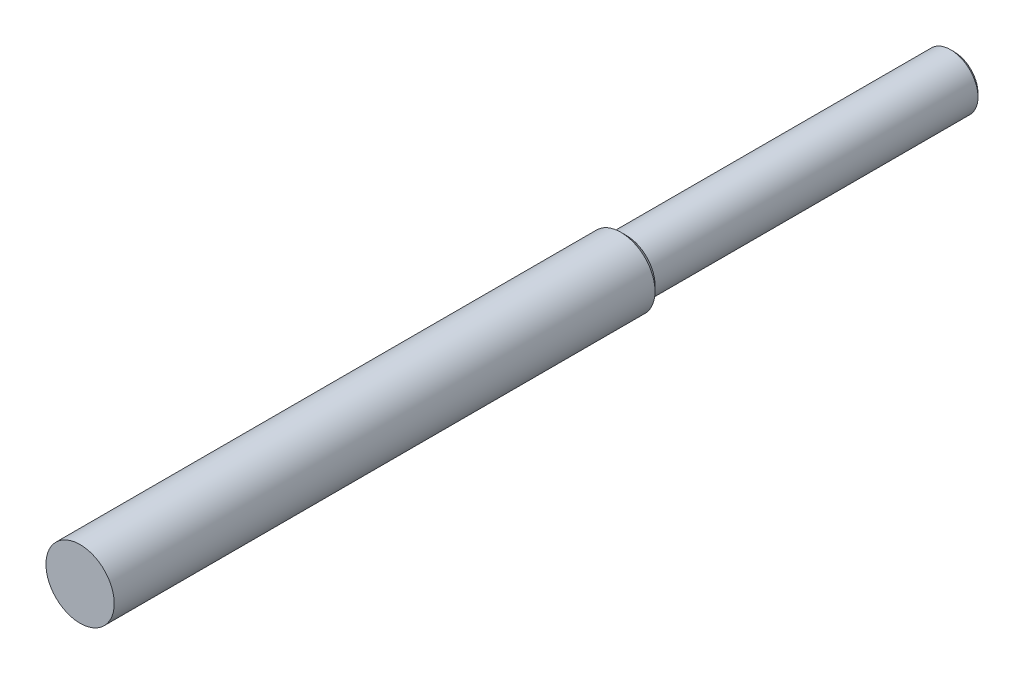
ISO-10303-21;
HEADER;
FILE_DESCRIPTION(('STEP AP214'),'2;1');
FILE_NAME('part.step','',(''),(''),'','','');
FILE_SCHEMA(('AUTOMOTIVE_DESIGN { 1 0 10303 214 1 1 1 1 }'));
ENDSEC;
DATA;
#1=APPLICATION_CONTEXT('core data for automotive mechanical design processes');
#2=APPLICATION_PROTOCOL_DEFINITION('international standard','automotive_design',2000,#1);
#3=PRODUCT_CONTEXT('',#1,'mechanical');
#4=PRODUCT('Part','Part','',(#3));
#5=PRODUCT_RELATED_PRODUCT_CATEGORY('part','',(#4));
#6=PRODUCT_DEFINITION_FORMATION('','',#4);
#7=PRODUCT_DEFINITION_CONTEXT('part definition',#1,'design');
#8=PRODUCT_DEFINITION('design','',#6,#7);
#9=PRODUCT_DEFINITION_SHAPE('','',#8);
#10=(LENGTH_UNIT() NAMED_UNIT(*) SI_UNIT(.MILLI.,.METRE.));
#11=(NAMED_UNIT(*) PLANE_ANGLE_UNIT() SI_UNIT($,.RADIAN.));
#12=(NAMED_UNIT(*) SI_UNIT($,.STERADIAN.) SOLID_ANGLE_UNIT());
#13=UNCERTAINTY_MEASURE_WITH_UNIT(LENGTH_MEASURE(1.E-05),#10,'distance_accuracy_value','');
#14=(GEOMETRIC_REPRESENTATION_CONTEXT(3) GLOBAL_UNCERTAINTY_ASSIGNED_CONTEXT((#13)) GLOBAL_UNIT_ASSIGNED_CONTEXT((#10,
#11,#12)) REPRESENTATION_CONTEXT('',''));
#15=CARTESIAN_POINT('',(0.,0.,0.));
#16=DIRECTION('',(0.,0.,1.));
#17=DIRECTION('',(1.,0.,0.));
#18=AXIS2_PLACEMENT_3D('',#15,#16,#17);
#19=CARTESIAN_POINT('',(0.,0.,0.));
#20=DIRECTION('',(0.,0.,1.));
#21=DIRECTION('',(1.,0.,0.));
#22=AXIS2_PLACEMENT_3D('',#19,#20,#21);
#23=PLANE('',#22);
#24=CARTESIAN_POINT('',(0.,0.,0.));
#25=DIRECTION('',(0.,0.,1.));
#26=DIRECTION('',(1.,0.,0.));
#27=AXIS2_PLACEMENT_3D('',#24,#25,#26);
#28=CIRCLE('',#27,10.5);
#29=CARTESIAN_POINT('',(10.5,0.,0.));
#30=VERTEX_POINT('',#29);
#31=EDGE_CURVE('E10',#30,#30,#28,.F.);
#32=ORIENTED_EDGE('',*,*,#31,.T.);
#33=EDGE_LOOP('',(#32));
#34=FACE_BOUND('',#33,.T.);
#35=CARTESIAN_POINT('',(0.,0.,0.));
#36=DIRECTION('',(0.,0.,1.));
#37=DIRECTION('',(1.,0.,0.));
#38=AXIS2_PLACEMENT_3D('',#35,#36,#37);
#39=CIRCLE('',#38,10.);
#40=CARTESIAN_POINT('',(10.,0.,0.));
#41=VERTEX_POINT('',#40);
#42=EDGE_CURVE('E50',#41,#41,#39,.F.);
#43=ORIENTED_EDGE('',*,*,#42,.F.);
#44=EDGE_LOOP('',(#43));
#45=FACE_BOUND('',#44,.T.);
#46=ADVANCED_FACE('F30',(#34,#45),#23,.F.);
#47=CARTESIAN_POINT('',(0.,0.,200.));
#48=DIRECTION('',(0.,0.,-1.));
#49=DIRECTION('',(-1.,0.,0.));
#50=AXIS2_PLACEMENT_3D('',#47,#48,#49);
#51=CYLINDRICAL_SURFACE('',#50,12.5);
#52=CARTESIAN_POINT('',(0.,0.,2.));
#53=DIRECTION('',(0.,0.,1.));
#54=DIRECTION('',(1.,0.,0.));
#55=AXIS2_PLACEMENT_3D('',#52,#53,#54);
#56=CIRCLE('',#55,12.5);
#57=CARTESIAN_POINT('',(12.5,0.,2.));
#58=VERTEX_POINT('',#57);
#59=EDGE_CURVE('E37',#58,#58,#56,.T.);
#60=ORIENTED_EDGE('',*,*,#59,.T.);
#61=EDGE_LOOP('',(#60));
#62=FACE_BOUND('',#61,.T.);
#63=CARTESIAN_POINT('',(0.,0.,200.));
#64=DIRECTION('',(0.,0.,1.));
#65=DIRECTION('',(1.,0.,0.));
#66=AXIS2_PLACEMENT_3D('',#63,#64,#65);
#67=CIRCLE('',#66,12.5);
#68=CARTESIAN_POINT('',(12.5,0.,200.));
#69=VERTEX_POINT('',#68);
#70=EDGE_CURVE('E53',#69,#69,#67,.T.);
#71=ORIENTED_EDGE('',*,*,#70,.F.);
#72=EDGE_LOOP('',(#71));
#73=FACE_BOUND('',#72,.T.);
#74=ADVANCED_FACE('F32',(#62,#73),#51,.T.);
#75=CARTESIAN_POINT('',(0.,0.,200.));
#76=DIRECTION('',(0.,0.,1.));
#77=DIRECTION('',(1.,0.,0.));
#78=AXIS2_PLACEMENT_3D('',#75,#76,#77);
#79=PLANE('',#78);
#80=ORIENTED_EDGE('',*,*,#70,.T.);
#81=EDGE_LOOP('',(#80));
#82=FACE_BOUND('',#81,.T.);
#83=ADVANCED_FACE('F57',(#82),#79,.T.);
#84=CARTESIAN_POINT('',(0.,0.,-120.));
#85=DIRECTION('',(0.,0.,1.));
#86=DIRECTION('',(1.,0.,0.));
#87=AXIS2_PLACEMENT_3D('',#84,#85,#86);
#88=CYLINDRICAL_SURFACE('',#87,10.);
#89=CARTESIAN_POINT('',(0.,0.,-118.75));
#90=DIRECTION('',(0.,0.,-1.));
#91=DIRECTION('',(-1.,0.,0.));
#92=AXIS2_PLACEMENT_3D('',#89,#90,#91);
#93=CIRCLE('',#92,10.);
#94=CARTESIAN_POINT('',(-10.,0.,-118.75));
#95=VERTEX_POINT('',#94);
#96=EDGE_CURVE('E41',#95,#95,#93,.F.);
#97=ORIENTED_EDGE('',*,*,#96,.T.);
#98=EDGE_LOOP('',(#97));
#99=FACE_BOUND('',#98,.T.);
#100=ORIENTED_EDGE('',*,*,#42,.T.);
#101=EDGE_LOOP('',(#100));
#102=FACE_BOUND('',#101,.T.);
#103=ADVANCED_FACE('F64',(#99,#102),#88,.T.);
#104=CARTESIAN_POINT('',(0.,0.,-120.));
#105=DIRECTION('',(0.,0.,-1.));
#106=DIRECTION('',(-1.,0.,0.));
#107=AXIS2_PLACEMENT_3D('',#104,#105,#106);
#108=PLANE('',#107);
#109=CARTESIAN_POINT('',(0.,0.,-120.));
#110=DIRECTION('',(0.,0.,-1.));
#111=DIRECTION('',(-1.,0.,0.));
#112=AXIS2_PLACEMENT_3D('',#109,#110,#111);
#113=CIRCLE('',#112,8.75);
#114=CARTESIAN_POINT('',(-8.75,0.,-120.));
#115=VERTEX_POINT('',#114);
#116=EDGE_CURVE('E45',#115,#115,#113,.T.);
#117=ORIENTED_EDGE('',*,*,#116,.T.);
#118=EDGE_LOOP('',(#117));
#119=FACE_BOUND('',#118,.T.);
#120=ADVANCED_FACE('F72',(#119),#108,.T.);
#121=CARTESIAN_POINT('',(0.,0.,-120.));
#122=DIRECTION('',(0.,0.,1.));
#123=DIRECTION('',(1.,0.,0.));
#124=AXIS2_PLACEMENT_3D('',#121,#122,#123);
#125=CONICAL_SURFACE('',#124,8.75,0.785398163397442);
#126=ORIENTED_EDGE('',*,*,#96,.F.);
#127=EDGE_LOOP('',(#126));
#128=FACE_BOUND('',#127,.T.);
#129=ORIENTED_EDGE('',*,*,#116,.F.);
#130=EDGE_LOOP('',(#129));
#131=FACE_BOUND('',#130,.T.);
#132=ADVANCED_FACE('F76',(#128,#131),#125,.T.);
#133=CARTESIAN_POINT('',(0.,0.,2.));
#134=DIRECTION('',(0.,0.,1.));
#135=DIRECTION('',(1.,0.,0.));
#136=AXIS2_PLACEMENT_3D('',#133,#134,#135);
#137=CONICAL_SURFACE('',#136,12.5,0.785398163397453);
#138=ORIENTED_EDGE('',*,*,#31,.F.);
#139=EDGE_LOOP('',(#138));
#140=FACE_BOUND('',#139,.T.);
#141=ORIENTED_EDGE('',*,*,#59,.F.);
#142=EDGE_LOOP('',(#141));
#143=FACE_BOUND('',#142,.T.);
#144=ADVANCED_FACE('F80',(#140,#143),#137,.T.);
#145=CLOSED_SHELL('',(#46,#74,#83,#103,#120,#132,#144));
#146=MANIFOLD_SOLID_BREP('B2',#145);
#147=ADVANCED_BREP_SHAPE_REPRESENTATION('',(#18,#146),#14);
#148=SHAPE_DEFINITION_REPRESENTATION(#9,#147);
ENDSEC;
END-ISO-10303-21;
